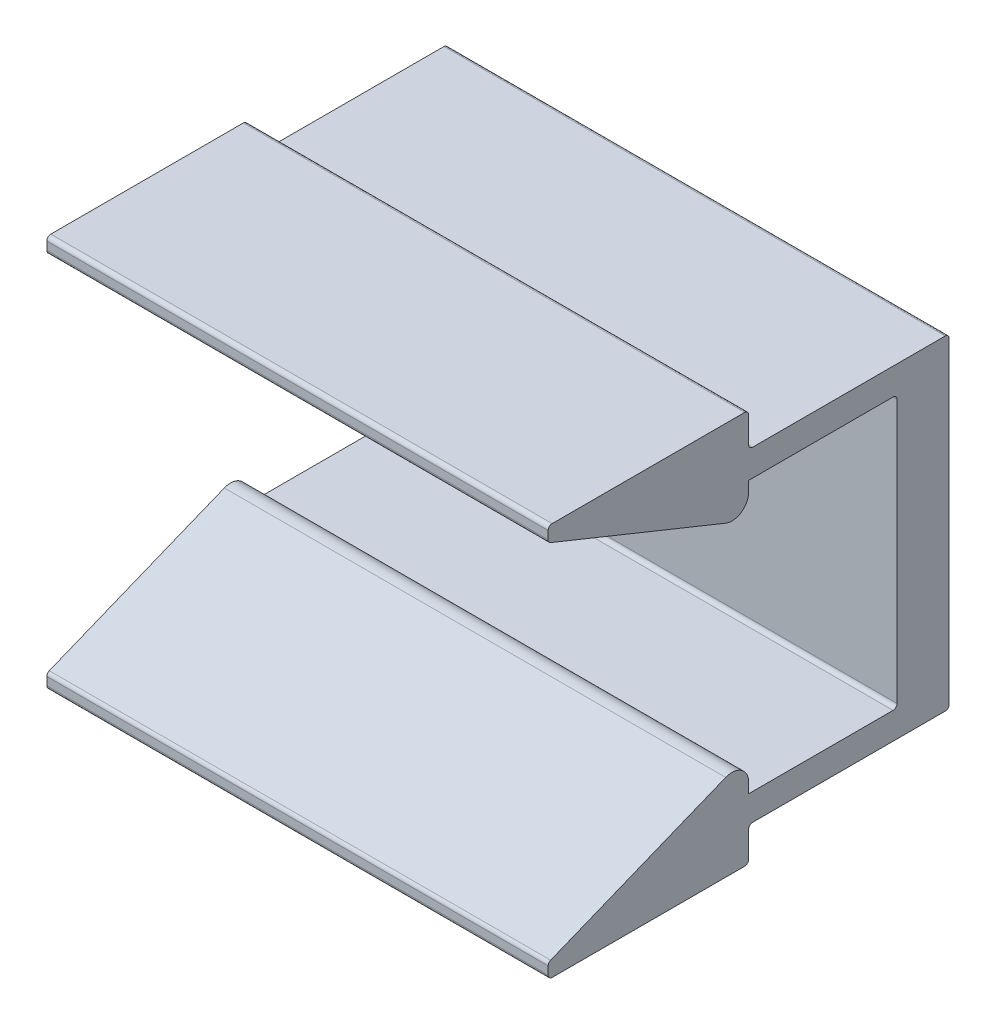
ISO-10303-21;
HEADER;
FILE_DESCRIPTION(('STEP AP214'),'2;1');
FILE_NAME('part.step','',(''),(''),'','','');
FILE_SCHEMA(('AUTOMOTIVE_DESIGN { 1 0 10303 214 1 1 1 1 }'));
ENDSEC;
DATA;
#1=APPLICATION_CONTEXT('core data for automotive mechanical design processes');
#2=APPLICATION_PROTOCOL_DEFINITION('international standard','automotive_design',2000,#1);
#3=PRODUCT_CONTEXT('',#1,'mechanical');
#4=PRODUCT('Part','Part','',(#3));
#5=PRODUCT_RELATED_PRODUCT_CATEGORY('part','',(#4));
#6=PRODUCT_DEFINITION_FORMATION('','',#4);
#7=PRODUCT_DEFINITION_CONTEXT('part definition',#1,'design');
#8=PRODUCT_DEFINITION('design','',#6,#7);
#9=PRODUCT_DEFINITION_SHAPE('','',#8);
#10=(LENGTH_UNIT() NAMED_UNIT(*) SI_UNIT(.MILLI.,.METRE.));
#11=(NAMED_UNIT(*) PLANE_ANGLE_UNIT() SI_UNIT($,.RADIAN.));
#12=(NAMED_UNIT(*) SI_UNIT($,.STERADIAN.) SOLID_ANGLE_UNIT());
#13=UNCERTAINTY_MEASURE_WITH_UNIT(LENGTH_MEASURE(1.E-05),#10,'distance_accuracy_value','');
#14=(GEOMETRIC_REPRESENTATION_CONTEXT(3) GLOBAL_UNCERTAINTY_ASSIGNED_CONTEXT((#13)) GLOBAL_UNIT_ASSIGNED_CONTEXT((#10,
#11,#12)) REPRESENTATION_CONTEXT('',''));
#15=CARTESIAN_POINT('',(0.,0.,0.));
#16=DIRECTION('',(0.,0.,1.));
#17=DIRECTION('',(1.,0.,0.));
#18=AXIS2_PLACEMENT_3D('',#15,#16,#17);
#19=CARTESIAN_POINT('',(23.8125,12.5095,4.953));
#20=DIRECTION('',(0.,0.,-1.));
#21=DIRECTION('',(-1.,0.,0.));
#22=AXIS2_PLACEMENT_3D('',#19,#20,#21);
#23=PLANE('',#22);
#24=DIRECTION('',(0.,-1.,0.));
#25=VECTOR('',#24,1.);
#26=CARTESIAN_POINT('',(-23.8125,12.5095,4.953));
#27=LINE('',#26,#25);
#28=CARTESIAN_POINT('',(-23.8125,12.5095,4.953));
#29=VERTEX_POINT('',#28);
#30=CARTESIAN_POINT('',(-23.8125,-12.5095,4.953));
#31=VERTEX_POINT('',#30);
#32=EDGE_CURVE('E218',#29,#31,#27,.T.);
#33=ORIENTED_EDGE('',*,*,#32,.T.);
#34=DIRECTION('',(-1.,0.,0.));
#35=VECTOR('',#34,1.);
#36=CARTESIAN_POINT('',(23.8125,-12.5095,4.953));
#37=LINE('',#36,#35);
#38=CARTESIAN_POINT('',(23.8125,-12.5095,4.953));
#39=VERTEX_POINT('',#38);
#40=EDGE_CURVE('E426',#39,#31,#37,.T.);
#41=ORIENTED_EDGE('',*,*,#40,.F.);
#42=DIRECTION('',(0.,-1.,0.));
#43=VECTOR('',#42,1.);
#44=CARTESIAN_POINT('',(23.8125,12.5095,4.953));
#45=LINE('',#44,#43);
#46=CARTESIAN_POINT('',(23.8125,12.5095,4.953));
#47=VERTEX_POINT('',#46);
#48=EDGE_CURVE('E293',#47,#39,#45,.T.);
#49=ORIENTED_EDGE('',*,*,#48,.F.);
#50=DIRECTION('',(-1.,0.,0.));
#51=VECTOR('',#50,1.);
#52=CARTESIAN_POINT('',(23.8125,12.5095,4.953));
#53=LINE('',#52,#51);
#54=EDGE_CURVE('E23',#47,#29,#53,.T.);
#55=ORIENTED_EDGE('',*,*,#54,.T.);
#56=EDGE_LOOP('',(#33,#41,#49,#55));
#57=FACE_BOUND('',#56,.T.);
#58=CARTESIAN_POINT('',(0.,0.,4.953));
#59=DIRECTION('',(0.,0.,-1.));
#60=DIRECTION('',(-1.,0.,0.));
#61=AXIS2_PLACEMENT_3D('',#58,#59,#60);
#62=CIRCLE('',#61,6.7437);
#63=CARTESIAN_POINT('',(-6.7437,0.,4.953));
#64=VERTEX_POINT('',#63);
#65=EDGE_CURVE('E230',#64,#64,#62,.F.);
#66=ORIENTED_EDGE('',*,*,#65,.F.);
#67=EDGE_LOOP('',(#66));
#68=FACE_BOUND('',#67,.T.);
#69=ADVANCED_FACE('F14',(#57,#68),#23,.F.);
#70=CARTESIAN_POINT('',(23.8125,-15.0495,0.));
#71=DIRECTION('',(0.,0.,1.));
#72=DIRECTION('',(1.,0.,0.));
#73=AXIS2_PLACEMENT_3D('',#70,#71,#72);
#74=PLANE('',#73);
#75=DIRECTION('',(0.,1.,0.));
#76=VECTOR('',#75,1.);
#77=CARTESIAN_POINT('',(-23.8125,-15.0495,0.));
#78=LINE('',#77,#76);
#79=CARTESIAN_POINT('',(-23.8125,-15.0495,0.));
#80=VERTEX_POINT('',#79);
#81=CARTESIAN_POINT('',(-23.8125,15.0495,0.));
#82=VERTEX_POINT('',#81);
#83=EDGE_CURVE('E264',#80,#82,#78,.T.);
#84=ORIENTED_EDGE('',*,*,#83,.T.);
#85=DIRECTION('',(-1.,0.,0.));
#86=VECTOR('',#85,1.);
#87=CARTESIAN_POINT('',(23.8125,15.0495,0.));
#88=LINE('',#87,#86);
#89=CARTESIAN_POINT('',(23.8125,15.0495,0.));
#90=VERTEX_POINT('',#89);
#91=EDGE_CURVE('E381',#90,#82,#88,.T.);
#92=ORIENTED_EDGE('',*,*,#91,.F.);
#93=DIRECTION('',(0.,1.,0.));
#94=VECTOR('',#93,1.);
#95=CARTESIAN_POINT('',(23.8125,-15.0495,0.));
#96=LINE('',#95,#94);
#97=CARTESIAN_POINT('',(23.8125,-15.0495,0.));
#98=VERTEX_POINT('',#97);
#99=EDGE_CURVE('E323',#98,#90,#96,.T.);
#100=ORIENTED_EDGE('',*,*,#99,.F.);
#101=DIRECTION('',(-1.,0.,0.));
#102=VECTOR('',#101,1.);
#103=CARTESIAN_POINT('',(23.8125,-15.0495,0.));
#104=LINE('',#103,#102);
#105=EDGE_CURVE('E384',#98,#80,#104,.T.);
#106=ORIENTED_EDGE('',*,*,#105,.T.);
#107=EDGE_LOOP('',(#84,#92,#100,#106));
#108=FACE_BOUND('',#107,.T.);
#109=CARTESIAN_POINT('',(0.,0.,0.));
#110=DIRECTION('',(0.,0.,1.));
#111=DIRECTION('',(1.,0.,0.));
#112=AXIS2_PLACEMENT_3D('',#109,#110,#111);
#113=CIRCLE('',#112,6.7437);
#114=CARTESIAN_POINT('',(6.7437,0.,0.));
#115=VERTEX_POINT('',#114);
#116=EDGE_CURVE('E18',#115,#115,#113,.F.);
#117=ORIENTED_EDGE('',*,*,#116,.F.);
#118=EDGE_LOOP('',(#117));
#119=FACE_BOUND('',#118,.T.);
#120=ADVANCED_FACE('F507',(#108,#119),#74,.F.);
#121=CARTESIAN_POINT('',(23.8125,12.8905,19.05));
#122=DIRECTION('',(0.,1.,0.));
#123=DIRECTION('',(-1.,0.,0.));
#124=AXIS2_PLACEMENT_3D('',#121,#122,#123);
#125=PLANE('',#124);
#126=DIRECTION('',(0.,0.,-1.));
#127=VECTOR('',#126,1.);
#128=CARTESIAN_POINT('',(-23.8125,12.8905,19.05));
#129=LINE('',#128,#127);
#130=CARTESIAN_POINT('',(-23.8125,12.8905,19.05));
#131=VERTEX_POINT('',#130);
#132=CARTESIAN_POINT('',(-23.8125,12.8905,5.334));
#133=VERTEX_POINT('',#132);
#134=EDGE_CURVE('E216',#131,#133,#129,.T.);
#135=ORIENTED_EDGE('',*,*,#134,.T.);
#136=DIRECTION('',(-1.,0.,0.));
#137=VECTOR('',#136,1.);
#138=CARTESIAN_POINT('',(23.8125,12.8905,5.334));
#139=LINE('',#138,#137);
#140=CARTESIAN_POINT('',(23.8125,12.8905,5.334));
#141=VERTEX_POINT('',#140);
#142=EDGE_CURVE('E9',#141,#133,#139,.T.);
#143=ORIENTED_EDGE('',*,*,#142,.F.);
#144=DIRECTION('',(0.,0.,-1.));
#145=VECTOR('',#144,1.);
#146=CARTESIAN_POINT('',(23.8125,12.8905,19.05));
#147=LINE('',#146,#145);
#148=CARTESIAN_POINT('',(23.8125,12.8905,19.05));
#149=VERTEX_POINT('',#148);
#150=EDGE_CURVE('E290',#149,#141,#147,.T.);
#151=ORIENTED_EDGE('',*,*,#150,.F.);
#152=DIRECTION('',(-1.,0.,0.));
#153=VECTOR('',#152,1.);
#154=CARTESIAN_POINT('',(23.8125,12.8905,19.05));
#155=LINE('',#154,#153);
#156=EDGE_CURVE('E229',#149,#131,#155,.T.);
#157=ORIENTED_EDGE('',*,*,#156,.T.);
#158=EDGE_LOOP('',(#135,#143,#151,#157));
#159=FACE_BOUND('',#158,.T.);
#160=ADVANCED_FACE('F16',(#159),#125,.F.);
#161=CARTESIAN_POINT('',(23.8125,12.5095,5.334));
#162=DIRECTION('',(-1.,0.,0.));
#163=DIRECTION('',(0.,-1.,0.));
#164=AXIS2_PLACEMENT_3D('',#161,#162,#163);
#165=CYLINDRICAL_SURFACE('',#164,0.381);
#166=CARTESIAN_POINT('',(-23.8125,12.5095,5.334));
#167=DIRECTION('',(-1.,0.,0.));
#168=DIRECTION('',(0.,-1.,0.));
#169=AXIS2_PLACEMENT_3D('',#166,#167,#168);
#170=CIRCLE('',#169,0.381);
#171=EDGE_CURVE('E212',#133,#29,#170,.T.);
#172=ORIENTED_EDGE('',*,*,#171,.T.);
#173=ORIENTED_EDGE('',*,*,#54,.F.);
#174=CARTESIAN_POINT('',(23.8125,12.5095,5.334));
#175=DIRECTION('',(-1.,0.,0.));
#176=DIRECTION('',(0.,-1.,0.));
#177=AXIS2_PLACEMENT_3D('',#174,#175,#176);
#178=CIRCLE('',#177,0.381);
#179=EDGE_CURVE('E225',#141,#47,#178,.T.);
#180=ORIENTED_EDGE('',*,*,#179,.F.);
#181=ORIENTED_EDGE('',*,*,#142,.T.);
#182=EDGE_LOOP('',(#172,#173,#180,#181));
#183=FACE_BOUND('',#182,.T.);
#184=ADVANCED_FACE('F224',(#183),#165,.F.);
#185=CARTESIAN_POINT('',(23.8125,-12.5095,5.334));
#186=DIRECTION('',(-1.,0.,0.));
#187=DIRECTION('',(0.,-1.,0.));
#188=AXIS2_PLACEMENT_3D('',#185,#186,#187);
#189=CYLINDRICAL_SURFACE('',#188,0.381);
#190=CARTESIAN_POINT('',(-23.8125,-12.5095,5.334));
#191=DIRECTION('',(-1.,0.,0.));
#192=DIRECTION('',(0.,1.,0.));
#193=AXIS2_PLACEMENT_3D('',#190,#191,#192);
#194=CIRCLE('',#193,0.381);
#195=CARTESIAN_POINT('',(-23.8125,-12.8905,5.334));
#196=VERTEX_POINT('',#195);
#197=EDGE_CURVE('E236',#31,#196,#194,.T.);
#198=ORIENTED_EDGE('',*,*,#197,.T.);
#199=DIRECTION('',(-1.,0.,0.));
#200=VECTOR('',#199,1.);
#201=CARTESIAN_POINT('',(23.8125,-12.8905,5.334));
#202=LINE('',#201,#200);
#203=CARTESIAN_POINT('',(23.8125,-12.8905,5.334));
#204=VERTEX_POINT('',#203);
#205=EDGE_CURVE('E423',#204,#196,#202,.T.);
#206=ORIENTED_EDGE('',*,*,#205,.F.);
#207=CARTESIAN_POINT('',(23.8125,-12.5095,5.334));
#208=DIRECTION('',(-1.,0.,0.));
#209=DIRECTION('',(0.,1.,0.));
#210=AXIS2_PLACEMENT_3D('',#207,#208,#209);
#211=CIRCLE('',#210,0.381);
#212=EDGE_CURVE('E295',#39,#204,#211,.T.);
#213=ORIENTED_EDGE('',*,*,#212,.F.);
#214=ORIENTED_EDGE('',*,*,#40,.T.);
#215=EDGE_LOOP('',(#198,#206,#213,#214));
#216=FACE_BOUND('',#215,.T.);
#217=ADVANCED_FACE('F439',(#216),#189,.F.);
#218=CARTESIAN_POINT('',(23.8125,-12.8905,19.05));
#219=DIRECTION('',(0.,-1.,0.));
#220=DIRECTION('',(1.,0.,0.));
#221=AXIS2_PLACEMENT_3D('',#218,#219,#220);
#222=PLANE('',#221);
#223=DIRECTION('',(0.,0.,1.));
#224=VECTOR('',#223,1.);
#225=CARTESIAN_POINT('',(-23.8125,-12.8905,19.05));
#226=LINE('',#225,#224);
#227=CARTESIAN_POINT('',(-23.8125,-12.8905,19.05));
#228=VERTEX_POINT('',#227);
#229=EDGE_CURVE('E238',#196,#228,#226,.T.);
#230=ORIENTED_EDGE('',*,*,#229,.T.);
#231=DIRECTION('',(-1.,0.,0.));
#232=VECTOR('',#231,1.);
#233=CARTESIAN_POINT('',(23.8125,-12.8905,19.05));
#234=LINE('',#233,#232);
#235=CARTESIAN_POINT('',(23.8125,-12.8905,19.05));
#236=VERTEX_POINT('',#235);
#237=EDGE_CURVE('E420',#236,#228,#234,.T.);
#238=ORIENTED_EDGE('',*,*,#237,.F.);
#239=DIRECTION('',(0.,0.,1.));
#240=VECTOR('',#239,1.);
#241=CARTESIAN_POINT('',(23.8125,-12.8905,19.05));
#242=LINE('',#241,#240);
#243=EDGE_CURVE('E297',#204,#236,#242,.T.);
#244=ORIENTED_EDGE('',*,*,#243,.F.);
#245=ORIENTED_EDGE('',*,*,#205,.T.);
#246=EDGE_LOOP('',(#230,#238,#244,#245));
#247=FACE_BOUND('',#246,.T.);
#248=ADVANCED_FACE('F442',(#247),#222,.F.);
#249=CARTESIAN_POINT('',(23.8125,-11.9288659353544,19.05));
#250=DIRECTION('',(0.,0.,1.));
#251=DIRECTION('',(1.,0.,0.));
#252=AXIS2_PLACEMENT_3D('',#249,#250,#251);
#253=PLANE('',#252);
#254=DIRECTION('',(0.,1.,0.));
#255=VECTOR('',#254,1.);
#256=CARTESIAN_POINT('',(-23.8125,-11.9288659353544,19.05));
#257=LINE('',#256,#255);
#258=CARTESIAN_POINT('',(-23.8125,-11.9288659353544,19.05));
#259=VERTEX_POINT('',#258);
#260=EDGE_CURVE('E240',#228,#259,#257,.T.);
#261=ORIENTED_EDGE('',*,*,#260,.T.);
#262=DIRECTION('',(-1.,0.,0.));
#263=VECTOR('',#262,1.);
#264=CARTESIAN_POINT('',(23.8125,-11.9288659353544,19.05));
#265=LINE('',#264,#263);
#266=CARTESIAN_POINT('',(23.8125,-11.9288659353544,19.05));
#267=VERTEX_POINT('',#266);
#268=EDGE_CURVE('E417',#267,#259,#265,.T.);
#269=ORIENTED_EDGE('',*,*,#268,.F.);
#270=DIRECTION('',(0.,1.,0.));
#271=VECTOR('',#270,1.);
#272=CARTESIAN_POINT('',(23.8125,-11.9288659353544,19.05));
#273=LINE('',#272,#271);
#274=EDGE_CURVE('E299',#236,#267,#273,.T.);
#275=ORIENTED_EDGE('',*,*,#274,.F.);
#276=ORIENTED_EDGE('',*,*,#237,.T.);
#277=EDGE_LOOP('',(#261,#269,#275,#276));
#278=FACE_BOUND('',#277,.T.);
#279=ADVANCED_FACE('F447',(#278),#253,.F.);
#280=CARTESIAN_POINT('',(23.8125,-11.9288659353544,20.6375));
#281=DIRECTION('',(-1.,0.,0.));
#282=DIRECTION('',(0.,-1.,0.));
#283=AXIS2_PLACEMENT_3D('',#280,#281,#282);
#284=CYLINDRICAL_SURFACE('',#283,1.5875);
#285=CARTESIAN_POINT('',(-23.8125,-11.9288659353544,20.6375));
#286=DIRECTION('',(1.,0.,0.));
#287=DIRECTION('',(0.,-1.,0.));
#288=AXIS2_PLACEMENT_3D('',#285,#286,#287);
#289=CIRCLE('',#288,1.5875);
#290=CARTESIAN_POINT('',(-23.8125,-10.4569615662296,21.2321879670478));
#291=VERTEX_POINT('',#290);
#292=EDGE_CURVE('E242',#259,#291,#289,.T.);
#293=ORIENTED_EDGE('',*,*,#292,.T.);
#294=DIRECTION('',(-1.,0.,0.));
#295=VECTOR('',#294,1.);
#296=CARTESIAN_POINT('',(23.8125,-10.4569615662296,21.2321879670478));
#297=LINE('',#296,#295);
#298=CARTESIAN_POINT('',(23.8125,-10.4569615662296,21.2321879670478));
#299=VERTEX_POINT('',#298);
#300=EDGE_CURVE('E414',#299,#291,#297,.T.);
#301=ORIENTED_EDGE('',*,*,#300,.F.);
#302=CARTESIAN_POINT('',(23.8125,-11.9288659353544,20.6375));
#303=DIRECTION('',(1.,0.,0.));
#304=DIRECTION('',(0.,-1.,0.));
#305=AXIS2_PLACEMENT_3D('',#302,#303,#304);
#306=CIRCLE('',#305,1.5875);
#307=EDGE_CURVE('E301',#267,#299,#306,.T.);
#308=ORIENTED_EDGE('',*,*,#307,.F.);
#309=ORIENTED_EDGE('',*,*,#268,.T.);
#310=EDGE_LOOP('',(#293,#301,#308,#309));
#311=FACE_BOUND('',#310,.T.);
#312=ADVANCED_FACE('F453',(#311),#284,.T.);
#313=CARTESIAN_POINT('',(23.8125,-17.175730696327,37.8617251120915));
#314=DIRECTION('',(0.,-0.92718385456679,-0.374606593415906));
#315=DIRECTION('',(0.,0.374606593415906,-0.92718385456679));
#316=AXIS2_PLACEMENT_3D('',#313,#314,#315);
#317=PLANE('',#316);
#318=DIRECTION('',(0.,-0.374606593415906,0.92718385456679));
#319=VECTOR('',#318,1.);
#320=CARTESIAN_POINT('',(-23.8125,-17.175730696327,37.8617251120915));
#321=LINE('',#320,#319);
#322=CARTESIAN_POINT('',(-23.8125,-17.175730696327,37.8617251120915));
#323=VERTEX_POINT('',#322);
#324=EDGE_CURVE('E244',#291,#323,#321,.T.);
#325=ORIENTED_EDGE('',*,*,#324,.T.);
#326=DIRECTION('',(-1.,0.,0.));
#327=VECTOR('',#326,1.);
#328=CARTESIAN_POINT('',(23.8125,-17.175730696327,37.8617251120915));
#329=LINE('',#328,#327);
#330=CARTESIAN_POINT('',(23.8125,-17.175730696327,37.8617251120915));
#331=VERTEX_POINT('',#330);
#332=EDGE_CURVE('E411',#331,#323,#329,.T.);
#333=ORIENTED_EDGE('',*,*,#332,.F.);
#334=DIRECTION('',(0.,-0.374606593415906,0.92718385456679));
#335=VECTOR('',#334,1.);
#336=CARTESIAN_POINT('',(23.8125,-17.175730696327,37.8617251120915));
#337=LINE('',#336,#335);
#338=EDGE_CURVE('E303',#299,#331,#337,.T.);
#339=ORIENTED_EDGE('',*,*,#338,.F.);
#340=ORIENTED_EDGE('',*,*,#300,.T.);
#341=EDGE_LOOP('',(#325,#333,#339,#340));
#342=FACE_BOUND('',#341,.T.);
#343=ADVANCED_FACE('F457',(#342),#317,.F.);
#344=CARTESIAN_POINT('',(23.8125,-17.528987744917,37.719));
#345=DIRECTION('',(-1.,0.,0.));
#346=DIRECTION('',(0.,-1.,0.));
#347=AXIS2_PLACEMENT_3D('',#344,#345,#346);
#348=CYLINDRICAL_SURFACE('',#347,0.381);
#349=CARTESIAN_POINT('',(-23.8125,-17.528987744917,37.719));
#350=DIRECTION('',(1.,0.,0.));
#351=DIRECTION('',(0.,-1.,0.));
#352=AXIS2_PLACEMENT_3D('',#349,#350,#351);
#353=CIRCLE('',#352,0.381);
#354=CARTESIAN_POINT('',(-23.8125,-17.528987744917,38.1));
#355=VERTEX_POINT('',#354);
#356=EDGE_CURVE('E246',#323,#355,#353,.T.);
#357=ORIENTED_EDGE('',*,*,#356,.T.);
#358=DIRECTION('',(-1.,0.,0.));
#359=VECTOR('',#358,1.);
#360=CARTESIAN_POINT('',(23.8125,-17.528987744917,38.1));
#361=LINE('',#360,#359);
#362=CARTESIAN_POINT('',(23.8125,-17.528987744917,38.1));
#363=VERTEX_POINT('',#362);
#364=EDGE_CURVE('E408',#363,#355,#361,.T.);
#365=ORIENTED_EDGE('',*,*,#364,.F.);
#366=CARTESIAN_POINT('',(23.8125,-17.528987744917,37.719));
#367=DIRECTION('',(1.,0.,0.));
#368=DIRECTION('',(0.,-1.,0.));
#369=AXIS2_PLACEMENT_3D('',#366,#367,#368);
#370=CIRCLE('',#369,0.381);
#371=EDGE_CURVE('E305',#331,#363,#370,.T.);
#372=ORIENTED_EDGE('',*,*,#371,.F.);
#373=ORIENTED_EDGE('',*,*,#332,.T.);
#374=EDGE_LOOP('',(#357,#365,#372,#373));
#375=FACE_BOUND('',#374,.T.);
#376=ADVANCED_FACE('F462',(#375),#348,.T.);
#377=CARTESIAN_POINT('',(23.8125,-18.288,38.1));
#378=DIRECTION('',(0.,0.,-1.));
#379=DIRECTION('',(0.,1.,0.));
#380=AXIS2_PLACEMENT_3D('',#377,#378,#379);
#381=PLANE('',#380);
#382=DIRECTION('',(0.,-1.,0.));
#383=VECTOR('',#382,1.);
#384=CARTESIAN_POINT('',(-23.8125,-18.288,38.1));
#385=LINE('',#384,#383);
#386=CARTESIAN_POINT('',(-23.8125,-18.288,38.1));
#387=VERTEX_POINT('',#386);
#388=EDGE_CURVE('E248',#355,#387,#385,.T.);
#389=ORIENTED_EDGE('',*,*,#388,.T.);
#390=DIRECTION('',(-1.,0.,0.));
#391=VECTOR('',#390,1.);
#392=CARTESIAN_POINT('',(23.8125,-18.288,38.1));
#393=LINE('',#392,#391);
#394=CARTESIAN_POINT('',(23.8125,-18.288,38.1));
#395=VERTEX_POINT('',#394);
#396=EDGE_CURVE('E405',#395,#387,#393,.T.);
#397=ORIENTED_EDGE('',*,*,#396,.F.);
#398=DIRECTION('',(0.,-1.,0.));
#399=VECTOR('',#398,1.);
#400=CARTESIAN_POINT('',(23.8125,-18.288,38.1));
#401=LINE('',#400,#399);
#402=EDGE_CURVE('E307',#363,#395,#401,.T.);
#403=ORIENTED_EDGE('',*,*,#402,.F.);
#404=ORIENTED_EDGE('',*,*,#364,.T.);
#405=EDGE_LOOP('',(#389,#397,#403,#404));
#406=FACE_BOUND('',#405,.T.);
#407=ADVANCED_FACE('F468',(#406),#381,.F.);
#408=CARTESIAN_POINT('',(23.8125,-18.288,37.719));
#409=DIRECTION('',(-1.,0.,0.));
#410=DIRECTION('',(0.,-1.,0.));
#411=AXIS2_PLACEMENT_3D('',#408,#409,#410);
#412=CYLINDRICAL_SURFACE('',#411,0.381);
#413=CARTESIAN_POINT('',(-23.8125,-18.288,37.719));
#414=DIRECTION('',(1.,0.,0.));
#415=DIRECTION('',(0.,-1.,0.));
#416=AXIS2_PLACEMENT_3D('',#413,#414,#415);
#417=CIRCLE('',#416,0.381);
#418=CARTESIAN_POINT('',(-23.8125,-18.669,37.719));
#419=VERTEX_POINT('',#418);
#420=EDGE_CURVE('E250',#387,#419,#417,.T.);
#421=ORIENTED_EDGE('',*,*,#420,.T.);
#422=DIRECTION('',(-1.,0.,0.));
#423=VECTOR('',#422,1.);
#424=CARTESIAN_POINT('',(23.8125,-18.669,37.719));
#425=LINE('',#424,#423);
#426=CARTESIAN_POINT('',(23.8125,-18.669,37.719));
#427=VERTEX_POINT('',#426);
#428=EDGE_CURVE('E402',#427,#419,#425,.T.);
#429=ORIENTED_EDGE('',*,*,#428,.F.);
#430=CARTESIAN_POINT('',(23.8125,-18.288,37.719));
#431=DIRECTION('',(1.,0.,0.));
#432=DIRECTION('',(0.,-1.,0.));
#433=AXIS2_PLACEMENT_3D('',#430,#431,#432);
#434=CIRCLE('',#433,0.381);
#435=EDGE_CURVE('E309',#395,#427,#434,.T.);
#436=ORIENTED_EDGE('',*,*,#435,.F.);
#437=ORIENTED_EDGE('',*,*,#396,.T.);
#438=EDGE_LOOP('',(#421,#429,#436,#437));
#439=FACE_BOUND('',#438,.T.);
#440=ADVANCED_FACE('F472',(#439),#412,.T.);
#441=CARTESIAN_POINT('',(23.8125,-18.669,19.431));
#442=DIRECTION('',(0.,1.,0.));
#443=DIRECTION('',(-1.,0.,0.));
#444=AXIS2_PLACEMENT_3D('',#441,#442,#443);
#445=PLANE('',#444);
#446=DIRECTION('',(0.,0.,-1.));
#447=VECTOR('',#446,1.);
#448=CARTESIAN_POINT('',(-23.8125,-18.669,19.431));
#449=LINE('',#448,#447);
#450=CARTESIAN_POINT('',(-23.8125,-18.669,19.431));
#451=VERTEX_POINT('',#450);
#452=EDGE_CURVE('E252',#419,#451,#449,.T.);
#453=ORIENTED_EDGE('',*,*,#452,.T.);
#454=DIRECTION('',(-1.,0.,0.));
#455=VECTOR('',#454,1.);
#456=CARTESIAN_POINT('',(23.8125,-18.669,19.431));
#457=LINE('',#456,#455);
#458=CARTESIAN_POINT('',(23.8125,-18.669,19.431));
#459=VERTEX_POINT('',#458);
#460=EDGE_CURVE('E399',#459,#451,#457,.T.);
#461=ORIENTED_EDGE('',*,*,#460,.F.);
#462=DIRECTION('',(0.,0.,-1.));
#463=VECTOR('',#462,1.);
#464=CARTESIAN_POINT('',(23.8125,-18.669,19.431));
#465=LINE('',#464,#463);
#466=EDGE_CURVE('E311',#427,#459,#465,.T.);
#467=ORIENTED_EDGE('',*,*,#466,.F.);
#468=ORIENTED_EDGE('',*,*,#428,.T.);
#469=EDGE_LOOP('',(#453,#461,#467,#468));
#470=FACE_BOUND('',#469,.T.);
#471=ADVANCED_FACE('F477',(#470),#445,.F.);
#472=CARTESIAN_POINT('',(23.8125,-18.288,19.431));
#473=DIRECTION('',(-1.,0.,0.));
#474=DIRECTION('',(0.,-1.,0.));
#475=AXIS2_PLACEMENT_3D('',#472,#473,#474);
#476=CYLINDRICAL_SURFACE('',#475,0.381);
#477=CARTESIAN_POINT('',(-23.8125,-18.288,19.431));
#478=DIRECTION('',(1.,0.,0.));
#479=DIRECTION('',(0.,-1.,0.));
#480=AXIS2_PLACEMENT_3D('',#477,#478,#479);
#481=CIRCLE('',#480,0.381);
#482=CARTESIAN_POINT('',(-23.8125,-18.288,19.05));
#483=VERTEX_POINT('',#482);
#484=EDGE_CURVE('E254',#451,#483,#481,.T.);
#485=ORIENTED_EDGE('',*,*,#484,.T.);
#486=DIRECTION('',(-1.,0.,0.));
#487=VECTOR('',#486,1.);
#488=CARTESIAN_POINT('',(23.8125,-18.288,19.05));
#489=LINE('',#488,#487);
#490=CARTESIAN_POINT('',(23.8125,-18.288,19.05));
#491=VERTEX_POINT('',#490);
#492=EDGE_CURVE('E396',#491,#483,#489,.T.);
#493=ORIENTED_EDGE('',*,*,#492,.F.);
#494=CARTESIAN_POINT('',(23.8125,-18.288,19.431));
#495=DIRECTION('',(1.,0.,0.));
#496=DIRECTION('',(0.,-1.,0.));
#497=AXIS2_PLACEMENT_3D('',#494,#495,#496);
#498=CIRCLE('',#497,0.381);
#499=EDGE_CURVE('E313',#459,#491,#498,.T.);
#500=ORIENTED_EDGE('',*,*,#499,.F.);
#501=ORIENTED_EDGE('',*,*,#460,.T.);
#502=EDGE_LOOP('',(#485,#493,#500,#501));
#503=FACE_BOUND('',#502,.T.);
#504=ADVANCED_FACE('F483',(#503),#476,.T.);
#505=CARTESIAN_POINT('',(23.8125,-15.8115,19.05));
#506=DIRECTION('',(0.,0.,1.));
#507=DIRECTION('',(1.,0.,0.));
#508=AXIS2_PLACEMENT_3D('',#505,#506,#507);
#509=PLANE('',#508);
#510=DIRECTION('',(0.,1.,0.));
#511=VECTOR('',#510,1.);
#512=CARTESIAN_POINT('',(-23.8125,-15.8115,19.05));
#513=LINE('',#512,#511);
#514=CARTESIAN_POINT('',(-23.8125,-15.8115,19.05));
#515=VERTEX_POINT('',#514);
#516=EDGE_CURVE('E256',#483,#515,#513,.T.);
#517=ORIENTED_EDGE('',*,*,#516,.T.);
#518=DIRECTION('',(-1.,0.,0.));
#519=VECTOR('',#518,1.);
#520=CARTESIAN_POINT('',(23.8125,-15.8115,19.05));
#521=LINE('',#520,#519);
#522=CARTESIAN_POINT('',(23.8125,-15.8115,19.05));
#523=VERTEX_POINT('',#522);
#524=EDGE_CURVE('E393',#523,#515,#521,.T.);
#525=ORIENTED_EDGE('',*,*,#524,.F.);
#526=DIRECTION('',(0.,1.,0.));
#527=VECTOR('',#526,1.);
#528=CARTESIAN_POINT('',(23.8125,-15.8115,19.05));
#529=LINE('',#528,#527);
#530=EDGE_CURVE('E315',#491,#523,#529,.T.);
#531=ORIENTED_EDGE('',*,*,#530,.F.);
#532=ORIENTED_EDGE('',*,*,#492,.T.);
#533=EDGE_LOOP('',(#517,#525,#531,#532));
#534=FACE_BOUND('',#533,.T.);
#535=ADVANCED_FACE('F487',(#534),#509,.F.);
#536=CARTESIAN_POINT('',(23.8125,-15.8115,18.669));
#537=DIRECTION('',(-1.,0.,0.));
#538=DIRECTION('',(0.,-1.,0.));
#539=AXIS2_PLACEMENT_3D('',#536,#537,#538);
#540=CYLINDRICAL_SURFACE('',#539,0.381);
#541=CARTESIAN_POINT('',(-23.8125,-15.8115,18.669));
#542=DIRECTION('',(-1.,0.,0.));
#543=DIRECTION('',(0.,1.,0.));
#544=AXIS2_PLACEMENT_3D('',#541,#542,#543);
#545=CIRCLE('',#544,0.381);
#546=CARTESIAN_POINT('',(-23.8125,-15.4305,18.669));
#547=VERTEX_POINT('',#546);
#548=EDGE_CURVE('E258',#515,#547,#545,.T.);
#549=ORIENTED_EDGE('',*,*,#548,.T.);
#550=DIRECTION('',(-1.,0.,0.));
#551=VECTOR('',#550,1.);
#552=CARTESIAN_POINT('',(23.8125,-15.4305,18.669));
#553=LINE('',#552,#551);
#554=CARTESIAN_POINT('',(23.8125,-15.4305,18.669));
#555=VERTEX_POINT('',#554);
#556=EDGE_CURVE('E390',#555,#547,#553,.T.);
#557=ORIENTED_EDGE('',*,*,#556,.F.);
#558=CARTESIAN_POINT('',(23.8125,-15.8115,18.669));
#559=DIRECTION('',(-1.,0.,0.));
#560=DIRECTION('',(0.,1.,0.));
#561=AXIS2_PLACEMENT_3D('',#558,#559,#560);
#562=CIRCLE('',#561,0.381);
#563=EDGE_CURVE('E317',#523,#555,#562,.T.);
#564=ORIENTED_EDGE('',*,*,#563,.F.);
#565=ORIENTED_EDGE('',*,*,#524,.T.);
#566=EDGE_LOOP('',(#549,#557,#564,#565));
#567=FACE_BOUND('',#566,.T.);
#568=ADVANCED_FACE('F492',(#567),#540,.F.);
#569=CARTESIAN_POINT('',(23.8125,-15.4305,0.381));
#570=DIRECTION('',(0.,1.,0.));
#571=DIRECTION('',(-1.,0.,0.));
#572=AXIS2_PLACEMENT_3D('',#569,#570,#571);
#573=PLANE('',#572);
#574=DIRECTION('',(0.,0.,-1.));
#575=VECTOR('',#574,1.);
#576=CARTESIAN_POINT('',(-23.8125,-15.4305,0.381));
#577=LINE('',#576,#575);
#578=CARTESIAN_POINT('',(-23.8125,-15.4305,0.381));
#579=VERTEX_POINT('',#578);
#580=EDGE_CURVE('E260',#547,#579,#577,.T.);
#581=ORIENTED_EDGE('',*,*,#580,.T.);
#582=DIRECTION('',(-1.,0.,0.));
#583=VECTOR('',#582,1.);
#584=CARTESIAN_POINT('',(23.8125,-15.4305,0.381));
#585=LINE('',#584,#583);
#586=CARTESIAN_POINT('',(23.8125,-15.4305,0.381));
#587=VERTEX_POINT('',#586);
#588=EDGE_CURVE('E387',#587,#579,#585,.T.);
#589=ORIENTED_EDGE('',*,*,#588,.F.);
#590=DIRECTION('',(0.,0.,-1.));
#591=VECTOR('',#590,1.);
#592=CARTESIAN_POINT('',(23.8125,-15.4305,0.381));
#593=LINE('',#592,#591);
#594=EDGE_CURVE('E319',#555,#587,#593,.T.);
#595=ORIENTED_EDGE('',*,*,#594,.F.);
#596=ORIENTED_EDGE('',*,*,#556,.T.);
#597=EDGE_LOOP('',(#581,#589,#595,#596));
#598=FACE_BOUND('',#597,.T.);
#599=ADVANCED_FACE('F498',(#598),#573,.F.);
#600=CARTESIAN_POINT('',(23.8125,-15.0495,0.381));
#601=DIRECTION('',(-1.,0.,0.));
#602=DIRECTION('',(0.,-1.,0.));
#603=AXIS2_PLACEMENT_3D('',#600,#601,#602);
#604=CYLINDRICAL_SURFACE('',#603,0.381);
#605=CARTESIAN_POINT('',(-23.8125,-15.0495,0.381));
#606=DIRECTION('',(1.,0.,0.));
#607=DIRECTION('',(0.,-1.,0.));
#608=AXIS2_PLACEMENT_3D('',#605,#606,#607);
#609=CIRCLE('',#608,0.381);
#610=EDGE_CURVE('E262',#579,#80,#609,.T.);
#611=ORIENTED_EDGE('',*,*,#610,.T.);
#612=ORIENTED_EDGE('',*,*,#105,.F.);
#613=CARTESIAN_POINT('',(23.8125,-15.0495,0.381));
#614=DIRECTION('',(1.,0.,0.));
#615=DIRECTION('',(0.,-1.,0.));
#616=AXIS2_PLACEMENT_3D('',#613,#614,#615);
#617=CIRCLE('',#616,0.381);
#618=EDGE_CURVE('E321',#587,#98,#617,.T.);
#619=ORIENTED_EDGE('',*,*,#618,.F.);
#620=ORIENTED_EDGE('',*,*,#588,.T.);
#621=EDGE_LOOP('',(#611,#612,#619,#620));
#622=FACE_BOUND('',#621,.T.);
#623=ADVANCED_FACE('F502',(#622),#604,.T.);
#624=CARTESIAN_POINT('',(23.8125,15.0495,0.381));
#625=DIRECTION('',(-1.,0.,0.));
#626=DIRECTION('',(0.,-1.,0.));
#627=AXIS2_PLACEMENT_3D('',#624,#625,#626);
#628=CYLINDRICAL_SURFACE('',#627,0.381);
#629=CARTESIAN_POINT('',(-23.8125,15.0495,0.381));
#630=DIRECTION('',(1.,0.,0.));
#631=DIRECTION('',(0.,1.,0.));
#632=AXIS2_PLACEMENT_3D('',#629,#630,#631);
#633=CIRCLE('',#632,0.381);
#634=CARTESIAN_POINT('',(-23.8125,15.4305,0.381));
#635=VERTEX_POINT('',#634);
#636=EDGE_CURVE('E266',#82,#635,#633,.T.);
#637=ORIENTED_EDGE('',*,*,#636,.T.);
#638=DIRECTION('',(-1.,0.,0.));
#639=VECTOR('',#638,1.);
#640=CARTESIAN_POINT('',(23.8125,15.4305,0.381));
#641=LINE('',#640,#639);
#642=CARTESIAN_POINT('',(23.8125,15.4305,0.381));
#643=VERTEX_POINT('',#642);
#644=EDGE_CURVE('E378',#643,#635,#641,.T.);
#645=ORIENTED_EDGE('',*,*,#644,.F.);
#646=CARTESIAN_POINT('',(23.8125,15.0495,0.381));
#647=DIRECTION('',(1.,0.,0.));
#648=DIRECTION('',(0.,1.,0.));
#649=AXIS2_PLACEMENT_3D('',#646,#647,#648);
#650=CIRCLE('',#649,0.381);
#651=EDGE_CURVE('E325',#90,#643,#650,.T.);
#652=ORIENTED_EDGE('',*,*,#651,.F.);
#653=ORIENTED_EDGE('',*,*,#91,.T.);
#654=EDGE_LOOP('',(#637,#645,#652,#653));
#655=FACE_BOUND('',#654,.T.);
#656=ADVANCED_FACE('F514',(#655),#628,.T.);
#657=CARTESIAN_POINT('',(23.8125,15.4305,0.381));
#658=DIRECTION('',(0.,-1.,0.));
#659=DIRECTION('',(1.,0.,0.));
#660=AXIS2_PLACEMENT_3D('',#657,#658,#659);
#661=PLANE('',#660);
#662=DIRECTION('',(0.,0.,1.));
#663=VECTOR('',#662,1.);
#664=CARTESIAN_POINT('',(-23.8125,15.4305,0.381));
#665=LINE('',#664,#663);
#666=CARTESIAN_POINT('',(-23.8125,15.4305,18.669));
#667=VERTEX_POINT('',#666);
#668=EDGE_CURVE('E268',#635,#667,#665,.T.);
#669=ORIENTED_EDGE('',*,*,#668,.T.);
#670=DIRECTION('',(-1.,0.,0.));
#671=VECTOR('',#670,1.);
#672=CARTESIAN_POINT('',(23.8125,15.4305,18.669));
#673=LINE('',#672,#671);
#674=CARTESIAN_POINT('',(23.8125,15.4305,18.669));
#675=VERTEX_POINT('',#674);
#676=EDGE_CURVE('E375',#675,#667,#673,.T.);
#677=ORIENTED_EDGE('',*,*,#676,.F.);
#678=DIRECTION('',(0.,0.,1.));
#679=VECTOR('',#678,1.);
#680=CARTESIAN_POINT('',(23.8125,15.4305,0.381));
#681=LINE('',#680,#679);
#682=EDGE_CURVE('E327',#643,#675,#681,.T.);
#683=ORIENTED_EDGE('',*,*,#682,.F.);
#684=ORIENTED_EDGE('',*,*,#644,.T.);
#685=EDGE_LOOP('',(#669,#677,#683,#684));
#686=FACE_BOUND('',#685,.T.);
#687=ADVANCED_FACE('F518',(#686),#661,.F.);
#688=CARTESIAN_POINT('',(23.8125,15.8115,18.669));
#689=DIRECTION('',(-1.,0.,0.));
#690=DIRECTION('',(0.,-1.,0.));
#691=AXIS2_PLACEMENT_3D('',#688,#689,#690);
#692=CYLINDRICAL_SURFACE('',#691,0.381);
#693=CARTESIAN_POINT('',(-23.8125,15.8115,18.669));
#694=DIRECTION('',(-1.,0.,0.));
#695=DIRECTION('',(0.,-1.,0.));
#696=AXIS2_PLACEMENT_3D('',#693,#694,#695);
#697=CIRCLE('',#696,0.381);
#698=CARTESIAN_POINT('',(-23.8125,15.8115,19.05));
#699=VERTEX_POINT('',#698);
#700=EDGE_CURVE('E270',#667,#699,#697,.T.);
#701=ORIENTED_EDGE('',*,*,#700,.T.);
#702=DIRECTION('',(-1.,0.,0.));
#703=VECTOR('',#702,1.);
#704=CARTESIAN_POINT('',(23.8125,15.8115,19.05));
#705=LINE('',#704,#703);
#706=CARTESIAN_POINT('',(23.8125,15.8115,19.05));
#707=VERTEX_POINT('',#706);
#708=EDGE_CURVE('E372',#707,#699,#705,.T.);
#709=ORIENTED_EDGE('',*,*,#708,.F.);
#710=CARTESIAN_POINT('',(23.8125,15.8115,18.669));
#711=DIRECTION('',(-1.,0.,0.));
#712=DIRECTION('',(0.,-1.,0.));
#713=AXIS2_PLACEMENT_3D('',#710,#711,#712);
#714=CIRCLE('',#713,0.381);
#715=EDGE_CURVE('E329',#675,#707,#714,.T.);
#716=ORIENTED_EDGE('',*,*,#715,.F.);
#717=ORIENTED_EDGE('',*,*,#676,.T.);
#718=EDGE_LOOP('',(#701,#709,#716,#717));
#719=FACE_BOUND('',#718,.T.);
#720=ADVANCED_FACE('F523',(#719),#692,.F.);
#721=CARTESIAN_POINT('',(23.8125,15.8115,19.05));
#722=DIRECTION('',(0.,0.,1.));
#723=DIRECTION('',(1.,0.,0.));
#724=AXIS2_PLACEMENT_3D('',#721,#722,#723);
#725=PLANE('',#724);
#726=DIRECTION('',(0.,1.,0.));
#727=VECTOR('',#726,1.);
#728=CARTESIAN_POINT('',(-23.8125,15.8115,19.05));
#729=LINE('',#728,#727);
#730=CARTESIAN_POINT('',(-23.8125,18.288,19.05));
#731=VERTEX_POINT('',#730);
#732=EDGE_CURVE('E272',#699,#731,#729,.T.);
#733=ORIENTED_EDGE('',*,*,#732,.T.);
#734=DIRECTION('',(-1.,0.,0.));
#735=VECTOR('',#734,1.);
#736=CARTESIAN_POINT('',(23.8125,18.288,19.05));
#737=LINE('',#736,#735);
#738=CARTESIAN_POINT('',(23.8125,18.288,19.05));
#739=VERTEX_POINT('',#738);
#740=EDGE_CURVE('E369',#739,#731,#737,.T.);
#741=ORIENTED_EDGE('',*,*,#740,.F.);
#742=DIRECTION('',(0.,1.,0.));
#743=VECTOR('',#742,1.);
#744=CARTESIAN_POINT('',(23.8125,15.8115,19.05));
#745=LINE('',#744,#743);
#746=EDGE_CURVE('E331',#707,#739,#745,.T.);
#747=ORIENTED_EDGE('',*,*,#746,.F.);
#748=ORIENTED_EDGE('',*,*,#708,.T.);
#749=EDGE_LOOP('',(#733,#741,#747,#748));
#750=FACE_BOUND('',#749,.T.);
#751=ADVANCED_FACE('F529',(#750),#725,.F.);
#752=CARTESIAN_POINT('',(23.8125,18.288,19.431));
#753=DIRECTION('',(-1.,0.,0.));
#754=DIRECTION('',(0.,-1.,0.));
#755=AXIS2_PLACEMENT_3D('',#752,#753,#754);
#756=CYLINDRICAL_SURFACE('',#755,0.381);
#757=CARTESIAN_POINT('',(-23.8125,18.288,19.431));
#758=DIRECTION('',(1.,0.,0.));
#759=DIRECTION('',(0.,1.,0.));
#760=AXIS2_PLACEMENT_3D('',#757,#758,#759);
#761=CIRCLE('',#760,0.381);
#762=CARTESIAN_POINT('',(-23.8125,18.669,19.431));
#763=VERTEX_POINT('',#762);
#764=EDGE_CURVE('E274',#731,#763,#761,.T.);
#765=ORIENTED_EDGE('',*,*,#764,.T.);
#766=DIRECTION('',(-1.,0.,0.));
#767=VECTOR('',#766,1.);
#768=CARTESIAN_POINT('',(23.8125,18.669,19.431));
#769=LINE('',#768,#767);
#770=CARTESIAN_POINT('',(23.8125,18.669,19.431));
#771=VERTEX_POINT('',#770);
#772=EDGE_CURVE('E366',#771,#763,#769,.T.);
#773=ORIENTED_EDGE('',*,*,#772,.F.);
#774=CARTESIAN_POINT('',(23.8125,18.288,19.431));
#775=DIRECTION('',(1.,0.,0.));
#776=DIRECTION('',(0.,1.,0.));
#777=AXIS2_PLACEMENT_3D('',#774,#775,#776);
#778=CIRCLE('',#777,0.381);
#779=EDGE_CURVE('E333',#739,#771,#778,.T.);
#780=ORIENTED_EDGE('',*,*,#779,.F.);
#781=ORIENTED_EDGE('',*,*,#740,.T.);
#782=EDGE_LOOP('',(#765,#773,#780,#781));
#783=FACE_BOUND('',#782,.T.);
#784=ADVANCED_FACE('F533',(#783),#756,.T.);
#785=CARTESIAN_POINT('',(23.8125,18.669,19.431));
#786=DIRECTION('',(0.,-1.,0.));
#787=DIRECTION('',(1.,0.,0.));
#788=AXIS2_PLACEMENT_3D('',#785,#786,#787);
#789=PLANE('',#788);
#790=DIRECTION('',(0.,0.,1.));
#791=VECTOR('',#790,1.);
#792=CARTESIAN_POINT('',(-23.8125,18.669,19.431));
#793=LINE('',#792,#791);
#794=CARTESIAN_POINT('',(-23.8125,18.669,37.719));
#795=VERTEX_POINT('',#794);
#796=EDGE_CURVE('E276',#763,#795,#793,.T.);
#797=ORIENTED_EDGE('',*,*,#796,.T.);
#798=DIRECTION('',(-1.,0.,0.));
#799=VECTOR('',#798,1.);
#800=CARTESIAN_POINT('',(23.8125,18.669,37.719));
#801=LINE('',#800,#799);
#802=CARTESIAN_POINT('',(23.8125,18.669,37.719));
#803=VERTEX_POINT('',#802);
#804=EDGE_CURVE('E363',#803,#795,#801,.T.);
#805=ORIENTED_EDGE('',*,*,#804,.F.);
#806=DIRECTION('',(0.,0.,1.));
#807=VECTOR('',#806,1.);
#808=CARTESIAN_POINT('',(23.8125,18.669,19.431));
#809=LINE('',#808,#807);
#810=EDGE_CURVE('E335',#771,#803,#809,.T.);
#811=ORIENTED_EDGE('',*,*,#810,.F.);
#812=ORIENTED_EDGE('',*,*,#772,.T.);
#813=EDGE_LOOP('',(#797,#805,#811,#812));
#814=FACE_BOUND('',#813,.T.);
#815=ADVANCED_FACE('F538',(#814),#789,.F.);
#816=CARTESIAN_POINT('',(23.8125,18.288,37.719));
#817=DIRECTION('',(-1.,0.,0.));
#818=DIRECTION('',(0.,-1.,0.));
#819=AXIS2_PLACEMENT_3D('',#816,#817,#818);
#820=CYLINDRICAL_SURFACE('',#819,0.381);
#821=CARTESIAN_POINT('',(-23.8125,18.288,37.719));
#822=DIRECTION('',(1.,0.,0.));
#823=DIRECTION('',(0.,1.,0.));
#824=AXIS2_PLACEMENT_3D('',#821,#822,#823);
#825=CIRCLE('',#824,0.381);
#826=CARTESIAN_POINT('',(-23.8125,18.288,38.1));
#827=VERTEX_POINT('',#826);
#828=EDGE_CURVE('E278',#795,#827,#825,.T.);
#829=ORIENTED_EDGE('',*,*,#828,.T.);
#830=DIRECTION('',(-1.,0.,0.));
#831=VECTOR('',#830,1.);
#832=CARTESIAN_POINT('',(23.8125,18.288,38.1));
#833=LINE('',#832,#831);
#834=CARTESIAN_POINT('',(23.8125,18.288,38.1));
#835=VERTEX_POINT('',#834);
#836=EDGE_CURVE('E360',#835,#827,#833,.T.);
#837=ORIENTED_EDGE('',*,*,#836,.F.);
#838=CARTESIAN_POINT('',(23.8125,18.288,37.719));
#839=DIRECTION('',(1.,0.,0.));
#840=DIRECTION('',(0.,1.,0.));
#841=AXIS2_PLACEMENT_3D('',#838,#839,#840);
#842=CIRCLE('',#841,0.381);
#843=EDGE_CURVE('E337',#803,#835,#842,.T.);
#844=ORIENTED_EDGE('',*,*,#843,.F.);
#845=ORIENTED_EDGE('',*,*,#804,.T.);
#846=EDGE_LOOP('',(#829,#837,#844,#845));
#847=FACE_BOUND('',#846,.T.);
#848=ADVANCED_FACE('F544',(#847),#820,.T.);
#849=CARTESIAN_POINT('',(23.8125,18.288,38.1));
#850=DIRECTION('',(0.,0.,-1.));
#851=DIRECTION('',(0.,1.,0.));
#852=AXIS2_PLACEMENT_3D('',#849,#850,#851);
#853=PLANE('',#852);
#854=DIRECTION('',(0.,-1.,0.));
#855=VECTOR('',#854,1.);
#856=CARTESIAN_POINT('',(-23.8125,18.288,38.1));
#857=LINE('',#856,#855);
#858=CARTESIAN_POINT('',(-23.8125,17.528987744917,38.1));
#859=VERTEX_POINT('',#858);
#860=EDGE_CURVE('E280',#827,#859,#857,.T.);
#861=ORIENTED_EDGE('',*,*,#860,.T.);
#862=DIRECTION('',(-1.,0.,0.));
#863=VECTOR('',#862,1.);
#864=CARTESIAN_POINT('',(23.8125,17.528987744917,38.1));
#865=LINE('',#864,#863);
#866=CARTESIAN_POINT('',(23.8125,17.528987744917,38.1));
#867=VERTEX_POINT('',#866);
#868=EDGE_CURVE('E357',#867,#859,#865,.T.);
#869=ORIENTED_EDGE('',*,*,#868,.F.);
#870=DIRECTION('',(0.,-1.,0.));
#871=VECTOR('',#870,1.);
#872=CARTESIAN_POINT('',(23.8125,18.288,38.1));
#873=LINE('',#872,#871);
#874=EDGE_CURVE('E339',#835,#867,#873,.T.);
#875=ORIENTED_EDGE('',*,*,#874,.F.);
#876=ORIENTED_EDGE('',*,*,#836,.T.);
#877=EDGE_LOOP('',(#861,#869,#875,#876));
#878=FACE_BOUND('',#877,.T.);
#879=ADVANCED_FACE('F548',(#878),#853,.F.);
#880=CARTESIAN_POINT('',(23.8125,17.528987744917,37.719));
#881=DIRECTION('',(-1.,0.,0.));
#882=DIRECTION('',(0.,-1.,0.));
#883=AXIS2_PLACEMENT_3D('',#880,#881,#882);
#884=CYLINDRICAL_SURFACE('',#883,0.381);
#885=CARTESIAN_POINT('',(-23.8125,17.528987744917,37.719));
#886=DIRECTION('',(1.,0.,0.));
#887=DIRECTION('',(0.,1.,0.));
#888=AXIS2_PLACEMENT_3D('',#885,#886,#887);
#889=CIRCLE('',#888,0.381);
#890=CARTESIAN_POINT('',(-23.8125,17.175730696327,37.8617251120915));
#891=VERTEX_POINT('',#890);
#892=EDGE_CURVE('E282',#859,#891,#889,.T.);
#893=ORIENTED_EDGE('',*,*,#892,.T.);
#894=DIRECTION('',(-1.,0.,0.));
#895=VECTOR('',#894,1.);
#896=CARTESIAN_POINT('',(23.8125,17.175730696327,37.8617251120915));
#897=LINE('',#896,#895);
#898=CARTESIAN_POINT('',(23.8125,17.175730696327,37.8617251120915));
#899=VERTEX_POINT('',#898);
#900=EDGE_CURVE('E354',#899,#891,#897,.T.);
#901=ORIENTED_EDGE('',*,*,#900,.F.);
#902=CARTESIAN_POINT('',(23.8125,17.528987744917,37.719));
#903=DIRECTION('',(1.,0.,0.));
#904=DIRECTION('',(0.,1.,0.));
#905=AXIS2_PLACEMENT_3D('',#902,#903,#904);
#906=CIRCLE('',#905,0.381);
#907=EDGE_CURVE('E341',#867,#899,#906,.T.);
#908=ORIENTED_EDGE('',*,*,#907,.F.);
#909=ORIENTED_EDGE('',*,*,#868,.T.);
#910=EDGE_LOOP('',(#893,#901,#908,#909));
#911=FACE_BOUND('',#910,.T.);
#912=ADVANCED_FACE('F553',(#911),#884,.T.);
#913=CARTESIAN_POINT('',(23.8125,17.175730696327,37.8617251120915));
#914=DIRECTION('',(0.,0.92718385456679,-0.374606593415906));
#915=DIRECTION('',(0.,0.374606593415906,0.92718385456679));
#916=AXIS2_PLACEMENT_3D('',#913,#914,#915);
#917=PLANE('',#916);
#918=DIRECTION('',(0.,-0.374606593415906,-0.92718385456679));
#919=VECTOR('',#918,1.);
#920=CARTESIAN_POINT('',(-23.8125,17.175730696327,37.8617251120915));
#921=LINE('',#920,#919);
#922=CARTESIAN_POINT('',(-23.8125,10.4569615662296,21.2321879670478));
#923=VERTEX_POINT('',#922);
#924=EDGE_CURVE('E284',#891,#923,#921,.T.);
#925=ORIENTED_EDGE('',*,*,#924,.T.);
#926=DIRECTION('',(-1.,0.,0.));
#927=VECTOR('',#926,1.);
#928=CARTESIAN_POINT('',(23.8125,10.4569615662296,21.2321879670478));
#929=LINE('',#928,#927);
#930=CARTESIAN_POINT('',(23.8125,10.4569615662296,21.2321879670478));
#931=VERTEX_POINT('',#930);
#932=EDGE_CURVE('E351',#931,#923,#929,.T.);
#933=ORIENTED_EDGE('',*,*,#932,.F.);
#934=DIRECTION('',(0.,-0.374606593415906,-0.92718385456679));
#935=VECTOR('',#934,1.);
#936=CARTESIAN_POINT('',(23.8125,17.175730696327,37.8617251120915));
#937=LINE('',#936,#935);
#938=EDGE_CURVE('E343',#899,#931,#937,.T.);
#939=ORIENTED_EDGE('',*,*,#938,.F.);
#940=ORIENTED_EDGE('',*,*,#900,.T.);
#941=EDGE_LOOP('',(#925,#933,#939,#940));
#942=FACE_BOUND('',#941,.T.);
#943=ADVANCED_FACE('F557',(#942),#917,.F.);
#944=CARTESIAN_POINT('',(23.8125,11.9288659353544,20.6375));
#945=DIRECTION('',(-1.,0.,0.));
#946=DIRECTION('',(0.,-1.,0.));
#947=AXIS2_PLACEMENT_3D('',#944,#945,#946);
#948=CYLINDRICAL_SURFACE('',#947,1.5875);
#949=CARTESIAN_POINT('',(-23.8125,11.9288659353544,20.6375));
#950=DIRECTION('',(1.,0.,0.));
#951=DIRECTION('',(0.,1.,0.));
#952=AXIS2_PLACEMENT_3D('',#949,#950,#951);
#953=CIRCLE('',#952,1.5875);
#954=CARTESIAN_POINT('',(-23.8125,11.9288659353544,19.05));
#955=VERTEX_POINT('',#954);
#956=EDGE_CURVE('E286',#923,#955,#953,.T.);
#957=ORIENTED_EDGE('',*,*,#956,.T.);
#958=DIRECTION('',(-1.,0.,0.));
#959=VECTOR('',#958,1.);
#960=CARTESIAN_POINT('',(23.8125,11.9288659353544,19.05));
#961=LINE('',#960,#959);
#962=CARTESIAN_POINT('',(23.8125,11.9288659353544,19.05));
#963=VERTEX_POINT('',#962);
#964=EDGE_CURVE('E348',#963,#955,#961,.T.);
#965=ORIENTED_EDGE('',*,*,#964,.F.);
#966=CARTESIAN_POINT('',(23.8125,11.9288659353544,20.6375));
#967=DIRECTION('',(1.,0.,0.));
#968=DIRECTION('',(0.,1.,0.));
#969=AXIS2_PLACEMENT_3D('',#966,#967,#968);
#970=CIRCLE('',#969,1.5875);
#971=EDGE_CURVE('E35',#931,#963,#970,.T.);
#972=ORIENTED_EDGE('',*,*,#971,.F.);
#973=ORIENTED_EDGE('',*,*,#932,.T.);
#974=EDGE_LOOP('',(#957,#965,#972,#973));
#975=FACE_BOUND('',#974,.T.);
#976=ADVANCED_FACE('F561',(#975),#948,.T.);
#977=CARTESIAN_POINT('',(23.8125,11.9288659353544,19.05));
#978=DIRECTION('',(0.,0.,1.));
#979=DIRECTION('',(1.,0.,0.));
#980=AXIS2_PLACEMENT_3D('',#977,#978,#979);
#981=PLANE('',#980);
#982=DIRECTION('',(0.,1.,0.));
#983=VECTOR('',#982,1.);
#984=CARTESIAN_POINT('',(-23.8125,11.9288659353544,19.05));
#985=LINE('',#984,#983);
#986=EDGE_CURVE('E288',#955,#131,#985,.T.);
#987=ORIENTED_EDGE('',*,*,#986,.T.);
#988=ORIENTED_EDGE('',*,*,#156,.F.);
#989=DIRECTION('',(0.,1.,0.));
#990=VECTOR('',#989,1.);
#991=CARTESIAN_POINT('',(23.8125,11.9288659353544,19.05));
#992=LINE('',#991,#990);
#993=EDGE_CURVE('E30',#963,#149,#992,.T.);
#994=ORIENTED_EDGE('',*,*,#993,.F.);
#995=ORIENTED_EDGE('',*,*,#964,.T.);
#996=EDGE_LOOP('',(#987,#988,#994,#995));
#997=FACE_BOUND('',#996,.T.);
#998=ADVANCED_FACE('F563',(#997),#981,.F.);
#999=CARTESIAN_POINT('',(23.8125,12.5095,5.334));
#1000=DIRECTION('',(-1.,0.,0.));
#1001=DIRECTION('',(0.,-1.,0.));
#1002=AXIS2_PLACEMENT_3D('',#999,#1000,#1001);
#1003=PLANE('',#1002);
#1004=ORIENTED_EDGE('',*,*,#150,.T.);
#1005=ORIENTED_EDGE('',*,*,#179,.T.);
#1006=ORIENTED_EDGE('',*,*,#48,.T.);
#1007=ORIENTED_EDGE('',*,*,#212,.T.);
#1008=ORIENTED_EDGE('',*,*,#243,.T.);
#1009=ORIENTED_EDGE('',*,*,#274,.T.);
#1010=ORIENTED_EDGE('',*,*,#307,.T.);
#1011=ORIENTED_EDGE('',*,*,#338,.T.);
#1012=ORIENTED_EDGE('',*,*,#371,.T.);
#1013=ORIENTED_EDGE('',*,*,#402,.T.);
#1014=ORIENTED_EDGE('',*,*,#435,.T.);
#1015=ORIENTED_EDGE('',*,*,#466,.T.);
#1016=ORIENTED_EDGE('',*,*,#499,.T.);
#1017=ORIENTED_EDGE('',*,*,#530,.T.);
#1018=ORIENTED_EDGE('',*,*,#563,.T.);
#1019=ORIENTED_EDGE('',*,*,#594,.T.);
#1020=ORIENTED_EDGE('',*,*,#618,.T.);
#1021=ORIENTED_EDGE('',*,*,#99,.T.);
#1022=ORIENTED_EDGE('',*,*,#651,.T.);
#1023=ORIENTED_EDGE('',*,*,#682,.T.);
#1024=ORIENTED_EDGE('',*,*,#715,.T.);
#1025=ORIENTED_EDGE('',*,*,#746,.T.);
#1026=ORIENTED_EDGE('',*,*,#779,.T.);
#1027=ORIENTED_EDGE('',*,*,#810,.T.);
#1028=ORIENTED_EDGE('',*,*,#843,.T.);
#1029=ORIENTED_EDGE('',*,*,#874,.T.);
#1030=ORIENTED_EDGE('',*,*,#907,.T.);
#1031=ORIENTED_EDGE('',*,*,#938,.T.);
#1032=ORIENTED_EDGE('',*,*,#971,.T.);
#1033=ORIENTED_EDGE('',*,*,#993,.T.);
#1034=EDGE_LOOP('',(#1004,#1005,#1006,#1007,#1008,#1009,#1010,#1011,#1012,#1013,#1014,#1015,
#1016,#1017,#1018,#1019,#1020,#1021,#1022,#1023,#1024,#1025,#1026,#1027,#1028,#1029,#1030,#1031,
#1032,#1033));
#1035=FACE_BOUND('',#1034,.T.);
#1036=ADVANCED_FACE('F434',(#1035),#1003,.F.);
#1037=CARTESIAN_POINT('',(-23.8125,12.5095,5.334));
#1038=DIRECTION('',(-1.,0.,0.));
#1039=DIRECTION('',(0.,-1.,0.));
#1040=AXIS2_PLACEMENT_3D('',#1037,#1038,#1039);
#1041=PLANE('',#1040);
#1042=ORIENTED_EDGE('',*,*,#134,.F.);
#1043=ORIENTED_EDGE('',*,*,#986,.F.);
#1044=ORIENTED_EDGE('',*,*,#956,.F.);
#1045=ORIENTED_EDGE('',*,*,#924,.F.);
#1046=ORIENTED_EDGE('',*,*,#892,.F.);
#1047=ORIENTED_EDGE('',*,*,#860,.F.);
#1048=ORIENTED_EDGE('',*,*,#828,.F.);
#1049=ORIENTED_EDGE('',*,*,#796,.F.);
#1050=ORIENTED_EDGE('',*,*,#764,.F.);
#1051=ORIENTED_EDGE('',*,*,#732,.F.);
#1052=ORIENTED_EDGE('',*,*,#700,.F.);
#1053=ORIENTED_EDGE('',*,*,#668,.F.);
#1054=ORIENTED_EDGE('',*,*,#636,.F.);
#1055=ORIENTED_EDGE('',*,*,#83,.F.);
#1056=ORIENTED_EDGE('',*,*,#610,.F.);
#1057=ORIENTED_EDGE('',*,*,#580,.F.);
#1058=ORIENTED_EDGE('',*,*,#548,.F.);
#1059=ORIENTED_EDGE('',*,*,#516,.F.);
#1060=ORIENTED_EDGE('',*,*,#484,.F.);
#1061=ORIENTED_EDGE('',*,*,#452,.F.);
#1062=ORIENTED_EDGE('',*,*,#420,.F.);
#1063=ORIENTED_EDGE('',*,*,#388,.F.);
#1064=ORIENTED_EDGE('',*,*,#356,.F.);
#1065=ORIENTED_EDGE('',*,*,#324,.F.);
#1066=ORIENTED_EDGE('',*,*,#292,.F.);
#1067=ORIENTED_EDGE('',*,*,#260,.F.);
#1068=ORIENTED_EDGE('',*,*,#229,.F.);
#1069=ORIENTED_EDGE('',*,*,#197,.F.);
#1070=ORIENTED_EDGE('',*,*,#32,.F.);
#1071=ORIENTED_EDGE('',*,*,#171,.F.);
#1072=EDGE_LOOP('',(#1042,#1043,#1044,#1045,#1046,#1047,#1048,#1049,#1050,#1051,#1052,#1053,
#1054,#1055,#1056,#1057,#1058,#1059,#1060,#1061,#1062,#1063,#1064,#1065,#1066,#1067,#1068,#1069,
#1070,#1071));
#1073=FACE_BOUND('',#1072,.T.);
#1074=ADVANCED_FACE('F213',(#1073),#1041,.T.);
#1075=CARTESIAN_POINT('',(0.,0.,8.84725331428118));
#1076=DIRECTION('',(0.,0.,1.));
#1077=DIRECTION('',(1.,0.,0.));
#1078=AXIS2_PLACEMENT_3D('',#1075,#1076,#1077);
#1079=CYLINDRICAL_SURFACE('',#1078,6.7437);
#1080=ORIENTED_EDGE('',*,*,#116,.T.);
#1081=EDGE_LOOP('',(#1080));
#1082=FACE_BOUND('',#1081,.T.);
#1083=ORIENTED_EDGE('',*,*,#65,.T.);
#1084=EDGE_LOOP('',(#1083));
#1085=FACE_BOUND('',#1084,.T.);
#1086=ADVANCED_FACE('F799',(#1082,#1085),#1079,.F.);
#1087=CLOSED_SHELL('',(#69,#120,#160,#184,#217,#248,#279,#312,#343,#376,#407,#440,#471,#504,
#535,#568,#599,#623,#656,#687,#720,#751,#784,#815,#848,#879,#912,#943,#976,#998,#1036,#1074,#1086));
#1088=MANIFOLD_SOLID_BREP('B1',#1087);
#1089=ADVANCED_BREP_SHAPE_REPRESENTATION('',(#18,#1088),#14);
#1090=SHAPE_DEFINITION_REPRESENTATION(#9,#1089);
ENDSEC;
END-ISO-10303-21;
